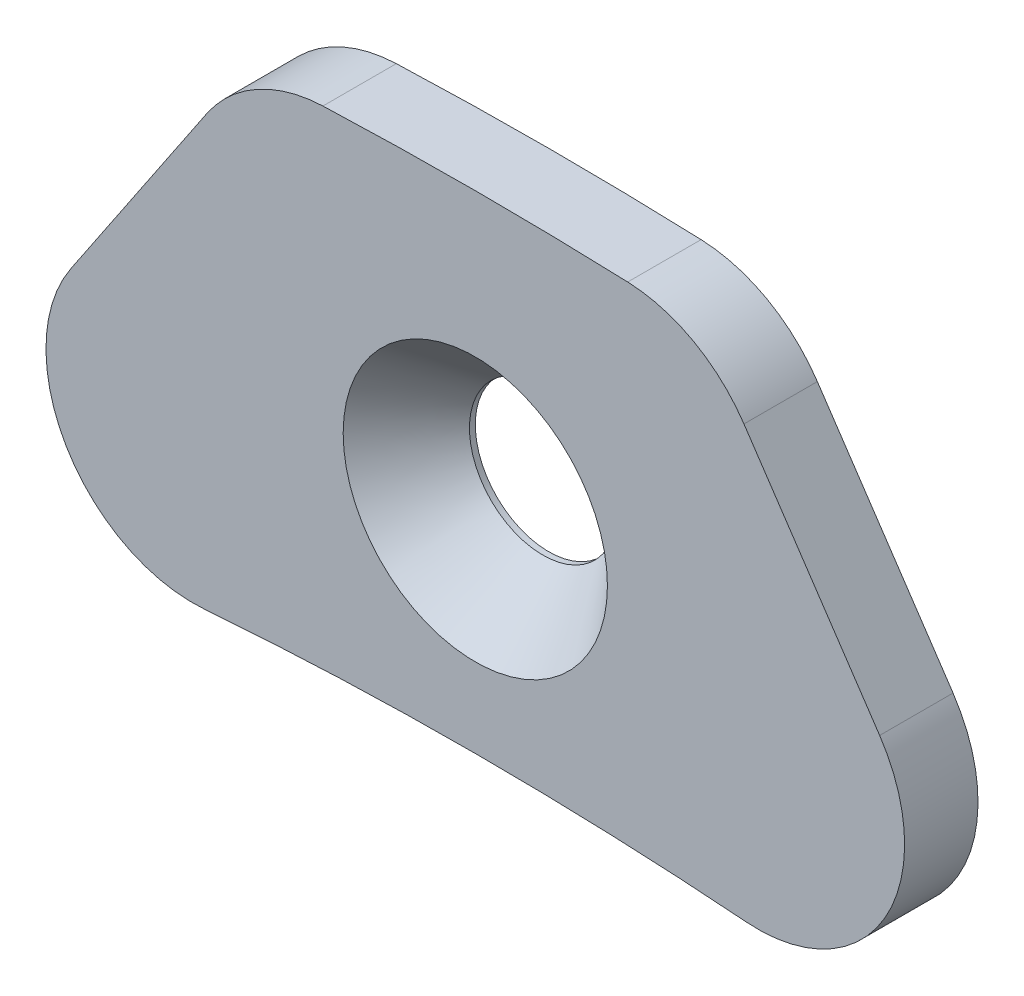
ISO-10303-21;
HEADER;
FILE_DESCRIPTION(('STEP AP214'),'2;1');
FILE_NAME('part.step','',(''),(''),'','','');
FILE_SCHEMA(('AUTOMOTIVE_DESIGN { 1 0 10303 214 1 1 1 1 }'));
ENDSEC;
DATA;
#1=APPLICATION_CONTEXT('core data for automotive mechanical design processes');
#2=APPLICATION_PROTOCOL_DEFINITION('international standard','automotive_design',2000,#1);
#3=PRODUCT_CONTEXT('',#1,'mechanical');
#4=PRODUCT('Part','Part','',(#3));
#5=PRODUCT_RELATED_PRODUCT_CATEGORY('part','',(#4));
#6=PRODUCT_DEFINITION_FORMATION('','',#4);
#7=PRODUCT_DEFINITION_CONTEXT('part definition',#1,'design');
#8=PRODUCT_DEFINITION('design','',#6,#7);
#9=PRODUCT_DEFINITION_SHAPE('','',#8);
#10=(LENGTH_UNIT() NAMED_UNIT(*) SI_UNIT(.MILLI.,.METRE.));
#11=(NAMED_UNIT(*) PLANE_ANGLE_UNIT() SI_UNIT($,.RADIAN.));
#12=(NAMED_UNIT(*) SI_UNIT($,.STERADIAN.) SOLID_ANGLE_UNIT());
#13=UNCERTAINTY_MEASURE_WITH_UNIT(LENGTH_MEASURE(1.E-05),#10,'distance_accuracy_value','');
#14=(GEOMETRIC_REPRESENTATION_CONTEXT(3) GLOBAL_UNCERTAINTY_ASSIGNED_CONTEXT((#13)) GLOBAL_UNIT_ASSIGNED_CONTEXT((#10,
#11,#12)) REPRESENTATION_CONTEXT('',''));
#15=CARTESIAN_POINT('',(0.,0.,0.));
#16=DIRECTION('',(0.,0.,1.));
#17=DIRECTION('',(1.,0.,0.));
#18=AXIS2_PLACEMENT_3D('',#15,#16,#17);
#19=CARTESIAN_POINT('',(3.175,83.442116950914,1.5875));
#20=DIRECTION('',(0.,0.,1.));
#21=DIRECTION('',(1.,0.,0.));
#22=AXIS2_PLACEMENT_3D('',#19,#20,#21);
#23=PLANE('',#22);
#24=CARTESIAN_POINT('',(0.,80.7085,1.5875));
#25=DIRECTION('',(0.,0.,1.));
#26=DIRECTION('',(1.,0.,0.));
#27=AXIS2_PLACEMENT_3D('',#24,#25,#26);
#28=CIRCLE('',#27,2.85750000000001);
#29=CARTESIAN_POINT('',(2.85750000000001,80.7085,1.5875));
#30=VERTEX_POINT('',#29);
#31=EDGE_CURVE('E11',#30,#30,#28,.F.);
#32=ORIENTED_EDGE('',*,*,#31,.T.);
#33=EDGE_LOOP('',(#32));
#34=FACE_BOUND('',#33,.T.);
#35=CARTESIAN_POINT('',(3.175,83.442116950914,1.5875));
#36=DIRECTION('',(0.,0.,1.));
#37=DIRECTION('',(1.,0.,0.));
#38=AXIS2_PLACEMENT_3D('',#35,#36,#37);
#39=CIRCLE('',#38,3.17500000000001);
#40=CARTESIAN_POINT('',(5.81011425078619,85.2132177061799,1.5875));
#41=VERTEX_POINT('',#40);
#42=CARTESIAN_POINT('',(3.29572243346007,86.6148210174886,1.5875));
#43=VERTEX_POINT('',#42);
#44=EDGE_CURVE('E149',#41,#43,#39,.T.);
#45=ORIENTED_EDGE('',*,*,#44,.T.);
#46=CARTESIAN_POINT('',(0.,0.,1.5875));
#47=DIRECTION('',(0.,0.,1.));
#48=DIRECTION('',(1.,0.,0.));
#49=AXIS2_PLACEMENT_3D('',#46,#47,#48);
#50=CIRCLE('',#49,86.6775);
#51=CARTESIAN_POINT('',(-3.29572243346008,86.6148210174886,1.5875));
#52=VERTEX_POINT('',#51);
#53=EDGE_CURVE('E98',#43,#52,#50,.T.);
#54=ORIENTED_EDGE('',*,*,#53,.T.);
#55=CARTESIAN_POINT('',(-3.175,83.442116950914,1.5875));
#56=DIRECTION('',(0.,0.,1.));
#57=DIRECTION('',(-1.,0.,0.));
#58=AXIS2_PLACEMENT_3D('',#55,#56,#57);
#59=CIRCLE('',#58,3.17500000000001);
#60=CARTESIAN_POINT('',(-5.81011425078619,85.2132177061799,1.5875));
#61=VERTEX_POINT('',#60);
#62=EDGE_CURVE('E220',#52,#61,#59,.T.);
#63=ORIENTED_EDGE('',*,*,#62,.T.);
#64=DIRECTION('',(-0.557827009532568,-0.829957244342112,0.));
#65=VECTOR('',#64,1.);
#66=CARTESIAN_POINT('',(-5.81011425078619,85.2132177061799,1.5875));
#67=LINE('',#66,#65);
#68=CARTESIAN_POINT('',(-8.74476573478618,80.8469263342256,1.5875));
#69=VERTEX_POINT('',#68);
#70=EDGE_CURVE('E222',#61,#69,#67,.T.);
#71=ORIENTED_EDGE('',*,*,#70,.T.);
#72=CARTESIAN_POINT('',(-6.109651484,79.0758255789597,1.5875));
#73=DIRECTION('',(0.,0.,1.));
#74=DIRECTION('',(-1.,0.,0.));
#75=AXIS2_PLACEMENT_3D('',#72,#73,#74);
#76=CIRCLE('',#75,3.17499999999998);
#77=CARTESIAN_POINT('',(-5.86506975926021,75.9102601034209,1.5875));
#78=VERTEX_POINT('',#77);
#79=EDGE_CURVE('E116',#69,#78,#76,.T.);
#80=ORIENTED_EDGE('',*,*,#79,.T.);
#81=CARTESIAN_POINT('',(0.,0.,1.5875));
#82=DIRECTION('',(0.,0.,-1.));
#83=DIRECTION('',(1.,0.,0.));
#84=AXIS2_PLACEMENT_3D('',#81,#82,#83);
#85=CIRCLE('',#84,76.1365);
#86=CARTESIAN_POINT('',(5.86506975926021,75.9102601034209,1.5875));
#87=VERTEX_POINT('',#86);
#88=EDGE_CURVE('E111',#78,#87,#85,.T.);
#89=ORIENTED_EDGE('',*,*,#88,.T.);
#90=CARTESIAN_POINT('',(6.109651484,79.0758255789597,1.5875));
#91=DIRECTION('',(0.,0.,1.));
#92=DIRECTION('',(-1.,0.,0.));
#93=AXIS2_PLACEMENT_3D('',#90,#91,#92);
#94=CIRCLE('',#93,3.17499999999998);
#95=CARTESIAN_POINT('',(8.74476573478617,80.8469263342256,1.5875));
#96=VERTEX_POINT('',#95);
#97=EDGE_CURVE('E114',#87,#96,#94,.T.);
#98=ORIENTED_EDGE('',*,*,#97,.T.);
#99=DIRECTION('',(-0.557827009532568,0.829957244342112,0.));
#100=VECTOR('',#99,1.);
#101=CARTESIAN_POINT('',(5.81011425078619,85.2132177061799,1.5875));
#102=LINE('',#101,#100);
#103=EDGE_CURVE('E54',#96,#41,#102,.T.);
#104=ORIENTED_EDGE('',*,*,#103,.T.);
#105=EDGE_LOOP('',(#45,#54,#63,#71,#80,#89,#98,#104));
#106=FACE_BOUND('',#105,.T.);
#107=ADVANCED_FACE('F37',(#34,#106),#23,.T.);
#108=CARTESIAN_POINT('',(3.175,83.442116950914,0.));
#109=DIRECTION('',(0.,0.,1.));
#110=DIRECTION('',(1.,0.,0.));
#111=AXIS2_PLACEMENT_3D('',#108,#109,#110);
#112=PLANE('',#111);
#113=CARTESIAN_POINT('',(3.175,83.442116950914,0.));
#114=DIRECTION('',(0.,0.,1.));
#115=DIRECTION('',(1.,0.,0.));
#116=AXIS2_PLACEMENT_3D('',#113,#114,#115);
#117=CIRCLE('',#116,3.17500000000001);
#118=CARTESIAN_POINT('',(5.81011425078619,85.2132177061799,0.));
#119=VERTEX_POINT('',#118);
#120=CARTESIAN_POINT('',(3.29572243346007,86.6148210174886,0.));
#121=VERTEX_POINT('',#120);
#122=EDGE_CURVE('E134',#119,#121,#117,.T.);
#123=ORIENTED_EDGE('',*,*,#122,.F.);
#124=DIRECTION('',(-0.557827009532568,0.829957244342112,0.));
#125=VECTOR('',#124,1.);
#126=CARTESIAN_POINT('',(5.81011425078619,85.2132177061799,0.));
#127=LINE('',#126,#125);
#128=CARTESIAN_POINT('',(8.74476573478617,80.8469263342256,0.));
#129=VERTEX_POINT('',#128);
#130=EDGE_CURVE('E89',#129,#119,#127,.T.);
#131=ORIENTED_EDGE('',*,*,#130,.F.);
#132=CARTESIAN_POINT('',(6.109651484,79.0758255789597,0.));
#133=DIRECTION('',(0.,0.,1.));
#134=DIRECTION('',(-1.,0.,0.));
#135=AXIS2_PLACEMENT_3D('',#132,#133,#134);
#136=CIRCLE('',#135,3.17499999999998);
#137=CARTESIAN_POINT('',(5.86506975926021,75.9102601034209,0.));
#138=VERTEX_POINT('',#137);
#139=EDGE_CURVE('E83',#138,#129,#136,.T.);
#140=ORIENTED_EDGE('',*,*,#139,.F.);
#141=CARTESIAN_POINT('',(0.,0.,0.));
#142=DIRECTION('',(0.,0.,-1.));
#143=DIRECTION('',(1.,0.,0.));
#144=AXIS2_PLACEMENT_3D('',#141,#142,#143);
#145=CIRCLE('',#144,76.1365);
#146=CARTESIAN_POINT('',(-5.86506975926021,75.9102601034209,0.));
#147=VERTEX_POINT('',#146);
#148=EDGE_CURVE('E124',#147,#138,#145,.T.);
#149=ORIENTED_EDGE('',*,*,#148,.F.);
#150=CARTESIAN_POINT('',(-6.109651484,79.0758255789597,0.));
#151=DIRECTION('',(0.,0.,1.));
#152=DIRECTION('',(-1.,0.,0.));
#153=AXIS2_PLACEMENT_3D('',#150,#151,#152);
#154=CIRCLE('',#153,3.17499999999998);
#155=CARTESIAN_POINT('',(-8.74476573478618,80.8469263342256,0.));
#156=VERTEX_POINT('',#155);
#157=EDGE_CURVE('E144',#156,#147,#154,.T.);
#158=ORIENTED_EDGE('',*,*,#157,.F.);
#159=DIRECTION('',(-0.557827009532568,-0.829957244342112,0.));
#160=VECTOR('',#159,1.);
#161=CARTESIAN_POINT('',(-5.81011425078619,85.2132177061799,0.));
#162=LINE('',#161,#160);
#163=CARTESIAN_POINT('',(-5.81011425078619,85.2132177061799,0.));
#164=VERTEX_POINT('',#163);
#165=EDGE_CURVE('E142',#164,#156,#162,.T.);
#166=ORIENTED_EDGE('',*,*,#165,.F.);
#167=CARTESIAN_POINT('',(-3.175,83.442116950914,0.));
#168=DIRECTION('',(0.,0.,1.));
#169=DIRECTION('',(-1.,0.,0.));
#170=AXIS2_PLACEMENT_3D('',#167,#168,#169);
#171=CIRCLE('',#170,3.17500000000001);
#172=CARTESIAN_POINT('',(-3.29572243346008,86.6148210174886,0.));
#173=VERTEX_POINT('',#172);
#174=EDGE_CURVE('E140',#173,#164,#171,.T.);
#175=ORIENTED_EDGE('',*,*,#174,.F.);
#176=CARTESIAN_POINT('',(0.,0.,0.));
#177=DIRECTION('',(0.,0.,1.));
#178=DIRECTION('',(1.,0.,0.));
#179=AXIS2_PLACEMENT_3D('',#176,#177,#178);
#180=CIRCLE('',#179,86.6775);
#181=EDGE_CURVE('E137',#121,#173,#180,.T.);
#182=ORIENTED_EDGE('',*,*,#181,.F.);
#183=EDGE_LOOP('',(#123,#131,#140,#149,#158,#166,#175,#182));
#184=FACE_BOUND('',#183,.T.);
#185=CARTESIAN_POINT('',(0.,80.7085,0.));
#186=DIRECTION('',(0.,0.,1.));
#187=DIRECTION('',(1.,0.,0.));
#188=AXIS2_PLACEMENT_3D('',#185,#186,#187);
#189=CIRCLE('',#188,1.5875);
#190=CARTESIAN_POINT('',(1.5875,80.7085,0.));
#191=VERTEX_POINT('',#190);
#192=EDGE_CURVE('E138',#191,#191,#189,.T.);
#193=ORIENTED_EDGE('',*,*,#192,.T.);
#194=EDGE_LOOP('',(#193));
#195=FACE_BOUND('',#194,.T.);
#196=ADVANCED_FACE('F178',(#184,#195),#112,.F.);
#197=CARTESIAN_POINT('',(3.175,83.442116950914,1.5875));
#198=DIRECTION('',(0.,0.,-1.));
#199=DIRECTION('',(-1.,0.,0.));
#200=AXIS2_PLACEMENT_3D('',#197,#198,#199);
#201=CYLINDRICAL_SURFACE('',#200,3.17500000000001);
#202=ORIENTED_EDGE('',*,*,#122,.T.);
#203=DIRECTION('',(0.,0.,-1.));
#204=VECTOR('',#203,1.);
#205=CARTESIAN_POINT('',(3.29572243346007,86.6148210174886,1.5875));
#206=LINE('',#205,#204);
#207=EDGE_CURVE('E162',#43,#121,#206,.T.);
#208=ORIENTED_EDGE('',*,*,#207,.F.);
#209=ORIENTED_EDGE('',*,*,#44,.F.);
#210=DIRECTION('',(0.,0.,-1.));
#211=VECTOR('',#210,1.);
#212=CARTESIAN_POINT('',(5.81011425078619,85.2132177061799,1.5875));
#213=LINE('',#212,#211);
#214=EDGE_CURVE('E130',#41,#119,#213,.T.);
#215=ORIENTED_EDGE('',*,*,#214,.T.);
#216=EDGE_LOOP('',(#202,#208,#209,#215));
#217=FACE_BOUND('',#216,.T.);
#218=ADVANCED_FACE('F184',(#217),#201,.T.);
#219=CARTESIAN_POINT('',(0.,0.,1.5875));
#220=DIRECTION('',(0.,0.,-1.));
#221=DIRECTION('',(-1.,0.,0.));
#222=AXIS2_PLACEMENT_3D('',#219,#220,#221);
#223=CYLINDRICAL_SURFACE('',#222,86.6775);
#224=ORIENTED_EDGE('',*,*,#181,.T.);
#225=DIRECTION('',(0.,0.,-1.));
#226=VECTOR('',#225,1.);
#227=CARTESIAN_POINT('',(-3.29572243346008,86.6148210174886,1.5875));
#228=LINE('',#227,#226);
#229=EDGE_CURVE('E159',#52,#173,#228,.T.);
#230=ORIENTED_EDGE('',*,*,#229,.F.);
#231=ORIENTED_EDGE('',*,*,#53,.F.);
#232=ORIENTED_EDGE('',*,*,#207,.T.);
#233=EDGE_LOOP('',(#224,#230,#231,#232));
#234=FACE_BOUND('',#233,.T.);
#235=ADVANCED_FACE('F205',(#234),#223,.T.);
#236=CARTESIAN_POINT('',(-3.175,83.442116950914,1.5875));
#237=DIRECTION('',(0.,0.,-1.));
#238=DIRECTION('',(-1.,0.,0.));
#239=AXIS2_PLACEMENT_3D('',#236,#237,#238);
#240=CYLINDRICAL_SURFACE('',#239,3.17500000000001);
#241=ORIENTED_EDGE('',*,*,#174,.T.);
#242=DIRECTION('',(0.,0.,-1.));
#243=VECTOR('',#242,1.);
#244=CARTESIAN_POINT('',(-5.81011425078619,85.2132177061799,1.5875));
#245=LINE('',#244,#243);
#246=EDGE_CURVE('E156',#61,#164,#245,.T.);
#247=ORIENTED_EDGE('',*,*,#246,.F.);
#248=ORIENTED_EDGE('',*,*,#62,.F.);
#249=ORIENTED_EDGE('',*,*,#229,.T.);
#250=EDGE_LOOP('',(#241,#247,#248,#249));
#251=FACE_BOUND('',#250,.T.);
#252=ADVANCED_FACE('F201',(#251),#240,.T.);
#253=CARTESIAN_POINT('',(-5.81011425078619,85.2132177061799,1.5875));
#254=DIRECTION('',(0.829957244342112,-0.557827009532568,0.));
#255=DIRECTION('',(0.557827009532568,0.829957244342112,0.));
#256=AXIS2_PLACEMENT_3D('',#253,#254,#255);
#257=PLANE('',#256);
#258=ORIENTED_EDGE('',*,*,#165,.T.);
#259=DIRECTION('',(0.,0.,-1.));
#260=VECTOR('',#259,1.);
#261=CARTESIAN_POINT('',(-8.74476573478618,80.8469263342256,1.5875));
#262=LINE('',#261,#260);
#263=EDGE_CURVE('E153',#69,#156,#262,.T.);
#264=ORIENTED_EDGE('',*,*,#263,.F.);
#265=ORIENTED_EDGE('',*,*,#70,.F.);
#266=ORIENTED_EDGE('',*,*,#246,.T.);
#267=EDGE_LOOP('',(#258,#264,#265,#266));
#268=FACE_BOUND('',#267,.T.);
#269=ADVANCED_FACE('F197',(#268),#257,.F.);
#270=CARTESIAN_POINT('',(-6.109651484,79.0758255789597,1.5875));
#271=DIRECTION('',(0.,0.,-1.));
#272=DIRECTION('',(-1.,0.,0.));
#273=AXIS2_PLACEMENT_3D('',#270,#271,#272);
#274=CYLINDRICAL_SURFACE('',#273,3.17499999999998);
#275=ORIENTED_EDGE('',*,*,#157,.T.);
#276=DIRECTION('',(0.,0.,-1.));
#277=VECTOR('',#276,1.);
#278=CARTESIAN_POINT('',(-5.86506975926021,75.9102601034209,1.5875));
#279=LINE('',#278,#277);
#280=EDGE_CURVE('E125',#78,#147,#279,.T.);
#281=ORIENTED_EDGE('',*,*,#280,.F.);
#282=ORIENTED_EDGE('',*,*,#79,.F.);
#283=ORIENTED_EDGE('',*,*,#263,.T.);
#284=EDGE_LOOP('',(#275,#281,#282,#283));
#285=FACE_BOUND('',#284,.T.);
#286=ADVANCED_FACE('F194',(#285),#274,.T.);
#287=CARTESIAN_POINT('',(0.,0.,1.5875));
#288=DIRECTION('',(0.,0.,-1.));
#289=DIRECTION('',(-1.,0.,0.));
#290=AXIS2_PLACEMENT_3D('',#287,#288,#289);
#291=CYLINDRICAL_SURFACE('',#290,76.1365);
#292=ORIENTED_EDGE('',*,*,#148,.T.);
#293=DIRECTION('',(0.,0.,-1.));
#294=VECTOR('',#293,1.);
#295=CARTESIAN_POINT('',(5.86506975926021,75.9102601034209,1.5875));
#296=LINE('',#295,#294);
#297=EDGE_CURVE('E121',#87,#138,#296,.T.);
#298=ORIENTED_EDGE('',*,*,#297,.F.);
#299=ORIENTED_EDGE('',*,*,#88,.F.);
#300=ORIENTED_EDGE('',*,*,#280,.T.);
#301=EDGE_LOOP('',(#292,#298,#299,#300));
#302=FACE_BOUND('',#301,.T.);
#303=ADVANCED_FACE('F122',(#302),#291,.F.);
#304=CARTESIAN_POINT('',(6.109651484,79.0758255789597,1.5875));
#305=DIRECTION('',(0.,0.,-1.));
#306=DIRECTION('',(-1.,0.,0.));
#307=AXIS2_PLACEMENT_3D('',#304,#305,#306);
#308=CYLINDRICAL_SURFACE('',#307,3.17499999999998);
#309=ORIENTED_EDGE('',*,*,#139,.T.);
#310=DIRECTION('',(0.,0.,-1.));
#311=VECTOR('',#310,1.);
#312=CARTESIAN_POINT('',(8.74476573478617,80.8469263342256,1.5875));
#313=LINE('',#312,#311);
#314=EDGE_CURVE('E126',#96,#129,#313,.T.);
#315=ORIENTED_EDGE('',*,*,#314,.F.);
#316=ORIENTED_EDGE('',*,*,#97,.F.);
#317=ORIENTED_EDGE('',*,*,#297,.T.);
#318=EDGE_LOOP('',(#309,#315,#316,#317));
#319=FACE_BOUND('',#318,.T.);
#320=ADVANCED_FACE('F128',(#319),#308,.T.);
#321=CARTESIAN_POINT('',(5.81011425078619,85.2132177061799,1.5875));
#322=DIRECTION('',(-0.829957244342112,-0.557827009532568,0.));
#323=DIRECTION('',(0.557827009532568,-0.829957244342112,0.));
#324=AXIS2_PLACEMENT_3D('',#321,#322,#323);
#325=PLANE('',#324);
#326=ORIENTED_EDGE('',*,*,#130,.T.);
#327=ORIENTED_EDGE('',*,*,#214,.F.);
#328=ORIENTED_EDGE('',*,*,#103,.F.);
#329=ORIENTED_EDGE('',*,*,#314,.T.);
#330=EDGE_LOOP('',(#326,#327,#328,#329));
#331=FACE_BOUND('',#330,.T.);
#332=ADVANCED_FACE('F174',(#331),#325,.F.);
#333=CARTESIAN_POINT('',(0.,80.7085,1.5875));
#334=DIRECTION('',(0.,0.,-1.));
#335=DIRECTION('',(-1.,0.,0.));
#336=AXIS2_PLACEMENT_3D('',#333,#334,#335);
#337=CYLINDRICAL_SURFACE('',#336,1.5875);
#338=CARTESIAN_POINT('',(0.,80.7085,0.126532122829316));
#339=DIRECTION('',(0.,0.,1.));
#340=DIRECTION('',(1.,0.,0.));
#341=AXIS2_PLACEMENT_3D('',#338,#339,#340);
#342=CIRCLE('',#341,1.5875);
#343=CARTESIAN_POINT('',(1.5875,80.7085,0.126532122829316));
#344=VERTEX_POINT('',#343);
#345=EDGE_CURVE('E46',#344,#344,#342,.T.);
#346=ORIENTED_EDGE('',*,*,#345,.T.);
#347=EDGE_LOOP('',(#346));
#348=FACE_BOUND('',#347,.T.);
#349=ORIENTED_EDGE('',*,*,#192,.F.);
#350=EDGE_LOOP('',(#349));
#351=FACE_BOUND('',#350,.T.);
#352=ADVANCED_FACE('F166',(#348,#351),#337,.F.);
#353=CARTESIAN_POINT('',(0.,80.7085,0.126532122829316));
#354=DIRECTION('',(0.,0.,1.));
#355=DIRECTION('',(1.,0.,0.));
#356=AXIS2_PLACEMENT_3D('',#353,#354,#355);
#357=CONICAL_SURFACE('',#356,1.5875,0.715584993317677);
#358=ORIENTED_EDGE('',*,*,#31,.F.);
#359=EDGE_LOOP('',(#358));
#360=FACE_BOUND('',#359,.T.);
#361=ORIENTED_EDGE('',*,*,#345,.F.);
#362=EDGE_LOOP('',(#361));
#363=FACE_BOUND('',#362,.T.);
#364=ADVANCED_FACE('F39',(#360,#363),#357,.F.);
#365=CLOSED_SHELL('',(#107,#196,#218,#235,#252,#269,#286,#303,#320,#332,#352,#364));
#366=MANIFOLD_SOLID_BREP('B2',#365);
#367=ADVANCED_BREP_SHAPE_REPRESENTATION('',(#18,#366),#14);
#368=SHAPE_DEFINITION_REPRESENTATION(#9,#367);
ENDSEC;
END-ISO-10303-21;
